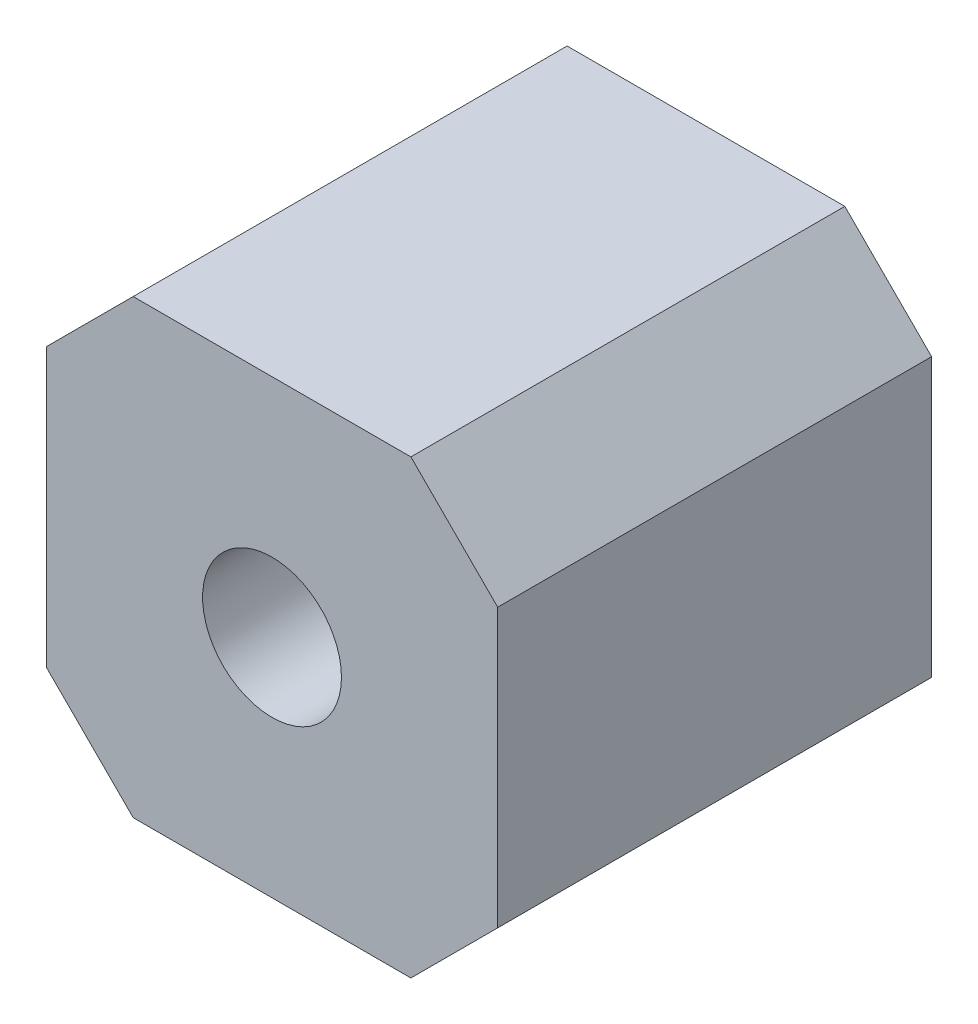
from build123d import *

# Parameters (mm, degrees)
ESQUISSE1_R          = 4
BASE_EXTRUSION_DEPTH = 25


with BuildPart() as part:
    # Esquisse1 → Base-Extrusion (new body)
    with BuildSketch(Plane.XY):
        Polygon((-13, 8), (-8, 13), (8, 13), (13, 8), (13, -8), (8, -13), (-8, -13), (-13, -8), align=None)
        Circle(ESQUISSE1_R, mode=Mode.SUBTRACT)
    extrude(amount=BASE_EXTRUSION_DEPTH)


solid = part.part
